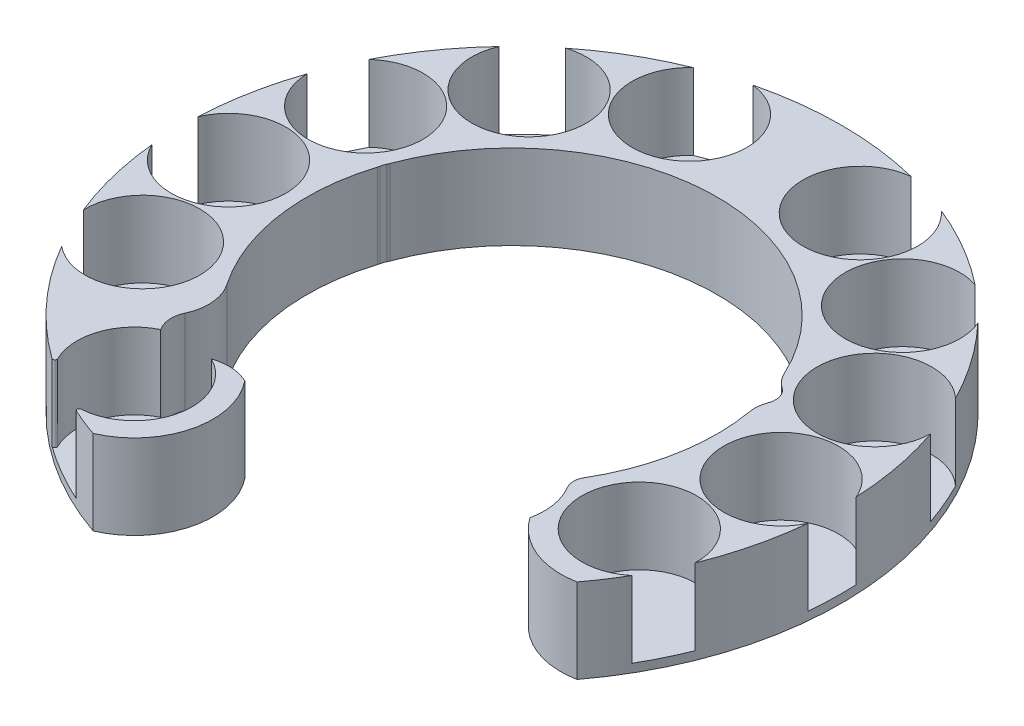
ISO-10303-21;
HEADER;
FILE_DESCRIPTION(('STEP AP214'),'2;1');
FILE_NAME('part.step','',(''),(''),'','','');
FILE_SCHEMA(('AUTOMOTIVE_DESIGN { 1 0 10303 214 1 1 1 1 }'));
ENDSEC;
DATA;
#1=APPLICATION_CONTEXT('core data for automotive mechanical design processes');
#2=APPLICATION_PROTOCOL_DEFINITION('international standard','automotive_design',2000,#1);
#3=PRODUCT_CONTEXT('',#1,'mechanical');
#4=PRODUCT('Part','Part','',(#3));
#5=PRODUCT_RELATED_PRODUCT_CATEGORY('part','',(#4));
#6=PRODUCT_DEFINITION_FORMATION('','',#4);
#7=PRODUCT_DEFINITION_CONTEXT('part definition',#1,'design');
#8=PRODUCT_DEFINITION('design','',#6,#7);
#9=PRODUCT_DEFINITION_SHAPE('','',#8);
#10=(LENGTH_UNIT() NAMED_UNIT(*) SI_UNIT(.MILLI.,.METRE.));
#11=(NAMED_UNIT(*) PLANE_ANGLE_UNIT() SI_UNIT($,.RADIAN.));
#12=(NAMED_UNIT(*) SI_UNIT($,.STERADIAN.) SOLID_ANGLE_UNIT());
#13=UNCERTAINTY_MEASURE_WITH_UNIT(LENGTH_MEASURE(1.E-05),#10,'distance_accuracy_value','');
#14=(GEOMETRIC_REPRESENTATION_CONTEXT(3) GLOBAL_UNCERTAINTY_ASSIGNED_CONTEXT((#13)) GLOBAL_UNIT_ASSIGNED_CONTEXT((#10,
#11,#12)) REPRESENTATION_CONTEXT('',''));
#15=CARTESIAN_POINT('',(0.,0.,0.));
#16=DIRECTION('',(0.,0.,1.));
#17=DIRECTION('',(1.,0.,0.));
#18=AXIS2_PLACEMENT_3D('',#15,#16,#17);
#19=CARTESIAN_POINT('',(0.,25.4,0.));
#20=DIRECTION('',(0.,1.,0.));
#21=DIRECTION('',(0.,0.,1.));
#22=AXIS2_PLACEMENT_3D('',#19,#20,#21);
#23=PLANE('',#22);
#24=CARTESIAN_POINT('',(-41.5400000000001,25.4,71.9493905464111));
#25=DIRECTION('',(0.,-1.,0.));
#26=DIRECTION('',(0.,0.,1.));
#27=AXIS2_PLACEMENT_3D('',#24,#25,#26);
#28=CIRCLE('',#27,23.6);
#29=CARTESIAN_POINT('',(-23.146761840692,25.4,57.1626130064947));
#30=VERTEX_POINT('',#29);
#31=CARTESIAN_POINT('',(-32.2750559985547,25.4,93.6547081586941));
#32=VERTEX_POINT('',#31);
#33=EDGE_CURVE('E321',#30,#32,#28,.T.);
#34=ORIENTED_EDGE('',*,*,#33,.F.);
#35=CARTESIAN_POINT('',(0.,25.4,0.));
#36=DIRECTION('',(0.,1.,0.));
#37=DIRECTION('',(0.,0.,1.));
#38=AXIS2_PLACEMENT_3D('',#35,#36,#37);
#39=CIRCLE('',#38,61.6712);
#40=CARTESIAN_POINT('',(-23.923346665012,25.4,56.8419773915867));
#41=VERTEX_POINT('',#40);
#42=EDGE_CURVE('E345',#41,#30,#39,.T.);
#43=ORIENTED_EDGE('',*,*,#42,.F.);
#44=CARTESIAN_POINT('',(-29.3425561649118,25.4,69.7180431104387));
#45=DIRECTION('',(0.,1.,0.));
#46=DIRECTION('',(0.,0.,-1.));
#47=AXIS2_PLACEMENT_3D('',#44,#45,#46);
#48=CIRCLE('',#47,13.97);
#49=CARTESIAN_POINT('',(-33.8656610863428,25.4,56.5005387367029));
#50=VERTEX_POINT('',#49);
#51=EDGE_CURVE('E663',#41,#50,#48,.T.);
#52=ORIENTED_EDGE('',*,*,#51,.T.);
#53=CARTESIAN_POINT('',(-41.5400000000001,25.4,71.9493905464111));
#54=DIRECTION('',(0.,1.,0.));
#55=DIRECTION('',(0.,0.,1.));
#56=AXIS2_PLACEMENT_3D('',#53,#54,#55);
#57=CIRCLE('',#56,17.25);
#58=CARTESIAN_POINT('',(-40.3533921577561,25.4,89.1585294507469));
#59=VERTEX_POINT('',#58);
#60=EDGE_CURVE('E469',#59,#50,#57,.T.);
#61=ORIENTED_EDGE('',*,*,#60,.F.);
#62=CARTESIAN_POINT('',(-40.3097112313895,25.4,89.7920252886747));
#63=DIRECTION('',(0.,1.,0.));
#64=DIRECTION('',(0.,0.,1.));
#65=AXIS2_PLACEMENT_3D('',#62,#63,#64);
#66=CIRCLE('',#65,0.635);
#67=CARTESIAN_POINT('',(-40.5697738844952,25.4,90.3713286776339));
#68=VERTEX_POINT('',#67);
#69=EDGE_CURVE('E443',#59,#68,#66,.T.);
#70=ORIENTED_EDGE('',*,*,#69,.T.);
#71=CARTESIAN_POINT('',(0.,25.4,0.));
#72=DIRECTION('',(0.,1.,0.));
#73=DIRECTION('',(0.,0.,1.));
#74=AXIS2_PLACEMENT_3D('',#71,#72,#73);
#75=CIRCLE('',#74,99.06);
#76=EDGE_CURVE('E341',#68,#32,#75,.T.);
#77=ORIENTED_EDGE('',*,*,#76,.T.);
#78=EDGE_LOOP('',(#34,#43,#52,#61,#70,#77));
#79=FACE_BOUND('',#78,.T.);
#80=ADVANCED_FACE('F35',(#79),#23,.T.);
#81=CARTESIAN_POINT('',(0.,25.4,0.));
#82=DIRECTION('',(0.,-1.,0.));
#83=DIRECTION('',(0.,0.,-1.));
#84=AXIS2_PLACEMENT_3D('',#81,#82,#83);
#85=CYLINDRICAL_SURFACE('',#84,61.6712);
#86=CARTESIAN_POINT('',(-58.8589391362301,25.4,-18.4109259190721));
#87=VERTEX_POINT('',#86);
#88=CARTESIAN_POINT('',(-50.9142683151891,25.4,34.8004912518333));
#89=VERTEX_POINT('',#88);
#90=EDGE_CURVE('E346',#87,#89,#39,.T.);
#91=ORIENTED_EDGE('',*,*,#90,.T.);
#92=DIRECTION('',(0.,-1.,0.));
#93=VECTOR('',#92,1.);
#94=CARTESIAN_POINT('',(-50.9142683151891,25.4,34.8004912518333));
#95=LINE('',#94,#93);
#96=CARTESIAN_POINT('',(-50.9142683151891,0.,34.8004912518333));
#97=VERTEX_POINT('',#96);
#98=EDGE_CURVE('E507',#89,#97,#95,.T.);
#99=ORIENTED_EDGE('',*,*,#98,.T.);
#100=CARTESIAN_POINT('',(0.,0.,0.));
#101=DIRECTION('',(0.,1.,0.));
#102=DIRECTION('',(0.,0.,1.));
#103=AXIS2_PLACEMENT_3D('',#100,#101,#102);
#104=CIRCLE('',#103,61.6712);
#105=CARTESIAN_POINT('',(-58.8589391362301,0.,-18.4109259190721));
#106=VERTEX_POINT('',#105);
#107=EDGE_CURVE('E486',#106,#97,#104,.T.);
#108=ORIENTED_EDGE('',*,*,#107,.F.);
#109=DIRECTION('',(0.,-1.,0.));
#110=VECTOR('',#109,1.);
#111=CARTESIAN_POINT('',(-58.8589391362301,25.4,-18.4109259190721));
#112=LINE('',#111,#110);
#113=EDGE_CURVE('E505',#87,#106,#112,.T.);
#114=ORIENTED_EDGE('',*,*,#113,.F.);
#115=EDGE_LOOP('',(#91,#99,#108,#114));
#116=FACE_BOUND('',#115,.T.);
#117=ADVANCED_FACE('F504',(#116),#85,.F.);
#118=CARTESIAN_POINT('',(-41.5400000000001,-48.7903679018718,71.9493905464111));
#119=DIRECTION('',(0.,1.,0.));
#120=DIRECTION('',(0.,0.,1.));
#121=AXIS2_PLACEMENT_3D('',#118,#119,#120);
#122=CYLINDRICAL_SURFACE('',#121,17.25);
#123=ORIENTED_EDGE('',*,*,#60,.T.);
#124=DIRECTION('',(0.,-1.,0.));
#125=VECTOR('',#124,1.);
#126=CARTESIAN_POINT('',(-33.8656610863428,12.7,56.5005387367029));
#127=LINE('',#126,#125);
#128=CARTESIAN_POINT('',(-33.8656610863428,2.54,56.5005387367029));
#129=VERTEX_POINT('',#128);
#130=EDGE_CURVE('E457',#50,#129,#127,.T.);
#131=ORIENTED_EDGE('',*,*,#130,.T.);
#132=CARTESIAN_POINT('',(-41.5400000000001,2.54,71.9493905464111));
#133=DIRECTION('',(0.,1.,0.));
#134=DIRECTION('',(0.,0.,1.));
#135=AXIS2_PLACEMENT_3D('',#132,#133,#134);
#136=CIRCLE('',#135,17.25);
#137=CARTESIAN_POINT('',(-40.3533921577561,2.54,89.1585294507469));
#138=VERTEX_POINT('',#137);
#139=EDGE_CURVE('E467',#129,#138,#136,.F.);
#140=ORIENTED_EDGE('',*,*,#139,.T.);
#141=DIRECTION('',(0.,1.,0.));
#142=VECTOR('',#141,1.);
#143=CARTESIAN_POINT('',(-40.3533921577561,-48.7903679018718,89.1585294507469));
#144=LINE('',#143,#142);
#145=EDGE_CURVE('E438',#138,#59,#144,.T.);
#146=ORIENTED_EDGE('',*,*,#145,.T.);
#147=EDGE_LOOP('',(#123,#131,#140,#146));
#148=FACE_BOUND('',#147,.T.);
#149=ADVANCED_FACE('F466',(#148),#122,.F.);
#150=CARTESIAN_POINT('',(53.1151758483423,25.4,31.3387141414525));
#151=VERTEX_POINT('',#150);
#152=CARTESIAN_POINT('',(60.7581620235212,25.4,-10.5727317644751));
#153=VERTEX_POINT('',#152);
#154=EDGE_CURVE('E336',#151,#153,#39,.T.);
#155=ORIENTED_EDGE('',*,*,#154,.T.);
#156=DIRECTION('',(0.,-1.,0.));
#157=VECTOR('',#156,1.);
#158=CARTESIAN_POINT('',(60.7581620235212,25.4,-10.5727317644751));
#159=LINE('',#158,#157);
#160=CARTESIAN_POINT('',(60.7581620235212,0.,-10.5727317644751));
#161=VERTEX_POINT('',#160);
#162=EDGE_CURVE('E532',#153,#161,#159,.T.);
#163=ORIENTED_EDGE('',*,*,#162,.T.);
#164=CARTESIAN_POINT('',(53.1151758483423,0.,31.3387141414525));
#165=VERTEX_POINT('',#164);
#166=EDGE_CURVE('E483',#165,#161,#104,.T.);
#167=ORIENTED_EDGE('',*,*,#166,.F.);
#168=DIRECTION('',(0.,-1.,0.));
#169=VECTOR('',#168,1.);
#170=CARTESIAN_POINT('',(53.1151758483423,25.4,31.3387141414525));
#171=LINE('',#170,#169);
#172=EDGE_CURVE('E583',#151,#165,#171,.T.);
#173=ORIENTED_EDGE('',*,*,#172,.F.);
#174=EDGE_LOOP('',(#155,#163,#167,#173));
#175=FACE_BOUND('',#174,.T.);
#176=ADVANCED_FACE('F738',(#175),#85,.F.);
#177=DIRECTION('',(0.,-1.,0.));
#178=VECTOR('',#177,1.);
#179=CARTESIAN_POINT('',(55.9881167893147,25.4,-25.8586095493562));
#180=LINE('',#179,#178);
#181=CARTESIAN_POINT('',(55.9881167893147,25.4,-25.8586095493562));
#182=VERTEX_POINT('',#181);
#183=CARTESIAN_POINT('',(55.9881167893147,0.,-25.8586095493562));
#184=VERTEX_POINT('',#183);
#185=EDGE_CURVE('E543',#182,#184,#180,.T.);
#186=ORIENTED_EDGE('',*,*,#185,.F.);
#187=CARTESIAN_POINT('',(-57.8967501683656,25.4,-21.2438986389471));
#188=VERTEX_POINT('',#187);
#189=EDGE_CURVE('E343',#182,#188,#39,.T.);
#190=ORIENTED_EDGE('',*,*,#189,.T.);
#191=DIRECTION('',(0.,-1.,0.));
#192=VECTOR('',#191,1.);
#193=CARTESIAN_POINT('',(-57.8967501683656,25.4,-21.2438986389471));
#194=LINE('',#193,#192);
#195=CARTESIAN_POINT('',(-57.8967501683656,0.,-21.2438986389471));
#196=VERTEX_POINT('',#195);
#197=EDGE_CURVE('E566',#188,#196,#194,.T.);
#198=ORIENTED_EDGE('',*,*,#197,.T.);
#199=EDGE_CURVE('E485',#184,#196,#104,.T.);
#200=ORIENTED_EDGE('',*,*,#199,.F.);
#201=EDGE_LOOP('',(#186,#190,#198,#200));
#202=FACE_BOUND('',#201,.T.);
#203=ADVANCED_FACE('F741',(#202),#85,.F.);
#204=CARTESIAN_POINT('',(74.6718093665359,25.4,36.4198748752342));
#205=DIRECTION('',(0.,-1.,0.));
#206=DIRECTION('',(0.,0.,1.));
#207=AXIS2_PLACEMENT_3D('',#204,#205,#206);
#208=CIRCLE('',#207,23.6);
#209=CARTESIAN_POINT('',(79.1282822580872,25.4,59.5952896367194));
#210=VERTEX_POINT('',#209);
#211=CARTESIAN_POINT('',(55.3450275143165,25.4,49.963711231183));
#212=VERTEX_POINT('',#211);
#213=EDGE_CURVE('E58',#210,#212,#208,.T.);
#214=ORIENTED_EDGE('',*,*,#213,.F.);
#215=CARTESIAN_POINT('',(85.698613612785,25.4,49.6853220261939));
#216=VERTEX_POINT('',#215);
#217=EDGE_CURVE('E330',#210,#216,#75,.T.);
#218=ORIENTED_EDGE('',*,*,#217,.T.);
#219=CARTESIAN_POINT('',(74.6718093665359,25.4,36.4198748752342));
#220=DIRECTION('',(0.,1.,0.));
#221=DIRECTION('',(0.,0.,1.));
#222=AXIS2_PLACEMENT_3D('',#219,#220,#221);
#223=CIRCLE('',#222,17.25);
#224=CARTESIAN_POINT('',(91.9139029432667,25.4,36.9420904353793));
#225=VERTEX_POINT('',#224);
#226=EDGE_CURVE('E585',#225,#216,#223,.T.);
#227=ORIENTED_EDGE('',*,*,#226,.F.);
#228=CARTESIAN_POINT('',(98.5865866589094,25.4,9.67308280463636));
#229=VERTEX_POINT('',#228);
#230=EDGE_CURVE('E691',#225,#229,#75,.T.);
#231=ORIENTED_EDGE('',*,*,#230,.T.);
#232=CARTESIAN_POINT('',(83.0515305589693,25.4,2.17478086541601));
#233=DIRECTION('',(0.,1.,0.));
#234=DIRECTION('',(0.,0.,1.));
#235=AXIS2_PLACEMENT_3D('',#232,#233,#234);
#236=CIRCLE('',#235,17.25);
#237=CARTESIAN_POINT('',(98.9577272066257,25.4,-4.5002028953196));
#238=VERTEX_POINT('',#237);
#239=EDGE_CURVE('E592',#238,#229,#236,.T.);
#240=ORIENTED_EDGE('',*,*,#239,.F.);
#241=CARTESIAN_POINT('',(93.7213377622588,25.4,-32.0810605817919));
#242=VERTEX_POINT('',#241);
#243=EDGE_CURVE('E693',#238,#242,#75,.T.);
#244=ORIENTED_EDGE('',*,*,#243,.T.);
#245=CARTESIAN_POINT('',(76.4755432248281,25.4,-32.4619421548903));
#246=DIRECTION('',(0.,1.,0.));
#247=DIRECTION('',(0.,0.,1.));
#248=AXIS2_PLACEMENT_3D('',#245,#246,#247);
#249=CIRCLE('',#248,17.25);
#250=CARTESIAN_POINT('',(88.1814954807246,25.4,-45.1321111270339));
#251=VERTEX_POINT('',#250);
#252=EDGE_CURVE('E598',#251,#242,#249,.T.);
#253=ORIENTED_EDGE('',*,*,#252,.F.);
#254=CARTESIAN_POINT('',(71.9789885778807,25.4,-68.058128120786));
#255=VERTEX_POINT('',#254);
#256=EDGE_CURVE('E696',#251,#255,#75,.T.);
#257=ORIENTED_EDGE('',*,*,#256,.T.);
#258=CARTESIAN_POINT('',(56.1280344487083,25.4,-61.2530011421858));
#259=DIRECTION('',(0.,1.,0.));
#260=DIRECTION('',(0.,0.,1.));
#261=AXIS2_PLACEMENT_3D('',#258,#259,#260);
#262=CIRCLE('',#261,17.25);
#263=CARTESIAN_POINT('',(61.5257641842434,25.4,-77.636743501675));
#264=VERTEX_POINT('',#263);
#265=EDGE_CURVE('E604',#264,#255,#262,.T.);
#266=ORIENTED_EDGE('',*,*,#265,.F.);
#267=CARTESIAN_POINT('',(37.2748460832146,25.4,-91.7794609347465));
#268=VERTEX_POINT('',#267);
#269=EDGE_CURVE('E699',#264,#268,#75,.T.);
#270=ORIENTED_EDGE('',*,*,#269,.T.);
#271=CARTESIAN_POINT('',(25.6731318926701,25.4,-79.0137753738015));
#272=DIRECTION('',(0.,1.,0.));
#273=DIRECTION('',(0.,0.,1.));
#274=AXIS2_PLACEMENT_3D('',#271,#272,#273);
#275=CIRCLE('',#274,17.25);
#276=CARTESIAN_POINT('',(23.7906296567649,25.4,-96.1607484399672));
#277=VERTEX_POINT('',#276);
#278=EDGE_CURVE('E610',#277,#268,#275,.T.);
#279=ORIENTED_EDGE('',*,*,#278,.F.);
#280=CARTESIAN_POINT('',(-23.7906296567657,25.4,-96.160748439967));
#281=VERTEX_POINT('',#280);
#282=EDGE_CURVE('E702',#277,#281,#75,.T.);
#283=ORIENTED_EDGE('',*,*,#282,.T.);
#284=CARTESIAN_POINT('',(-25.6731318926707,25.4,-79.0137753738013));
#285=DIRECTION('',(0.,1.,0.));
#286=DIRECTION('',(0.,0.,1.));
#287=AXIS2_PLACEMENT_3D('',#284,#285,#286);
#288=CIRCLE('',#287,17.25);
#289=CARTESIAN_POINT('',(-37.2748460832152,25.4,-91.7794609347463));
#290=VERTEX_POINT('',#289);
#291=EDGE_CURVE('E616',#290,#281,#288,.T.);
#292=ORIENTED_EDGE('',*,*,#291,.F.);
#293=CARTESIAN_POINT('',(-61.525764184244,25.4,-77.6367435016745));
#294=VERTEX_POINT('',#293);
#295=EDGE_CURVE('E705',#290,#294,#75,.T.);
#296=ORIENTED_EDGE('',*,*,#295,.T.);
#297=CARTESIAN_POINT('',(-56.1280344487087,25.4,-61.2530011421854));
#298=DIRECTION('',(0.,1.,0.));
#299=DIRECTION('',(0.,0.,1.));
#300=AXIS2_PLACEMENT_3D('',#297,#298,#299);
#301=CIRCLE('',#300,17.25);
#302=CARTESIAN_POINT('',(-71.9789885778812,25.4,-68.0581281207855));
#303=VERTEX_POINT('',#302);
#304=EDGE_CURVE('E622',#303,#294,#301,.T.);
#305=ORIENTED_EDGE('',*,*,#304,.F.);
#306=CARTESIAN_POINT('',(-88.181495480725,25.4,-45.1321111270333));
#307=VERTEX_POINT('',#306);
#308=EDGE_CURVE('E708',#303,#307,#75,.T.);
#309=ORIENTED_EDGE('',*,*,#308,.T.);
#310=CARTESIAN_POINT('',(-76.4755432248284,25.4,-32.4619421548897));
#311=DIRECTION('',(0.,1.,0.));
#312=DIRECTION('',(0.,0.,1.));
#313=AXIS2_PLACEMENT_3D('',#310,#311,#312);
#314=CIRCLE('',#313,17.25);
#315=CARTESIAN_POINT('',(-93.7213377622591,25.4,-32.081060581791));
#316=VERTEX_POINT('',#315);
#317=EDGE_CURVE('E628',#316,#307,#314,.T.);
#318=ORIENTED_EDGE('',*,*,#317,.F.);
#319=CARTESIAN_POINT('',(-98.9577272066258,25.4,-4.50020289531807));
#320=VERTEX_POINT('',#319);
#321=EDGE_CURVE('E711',#316,#320,#75,.T.);
#322=ORIENTED_EDGE('',*,*,#321,.T.);
#323=CARTESIAN_POINT('',(-83.0515305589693,25.4,2.17478086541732));
#324=DIRECTION('',(0.,1.,0.));
#325=DIRECTION('',(0.,0.,1.));
#326=AXIS2_PLACEMENT_3D('',#323,#324,#325);
#327=CIRCLE('',#326,17.25);
#328=CARTESIAN_POINT('',(-98.5865866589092,25.4,9.67308280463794));
#329=VERTEX_POINT('',#328);
#330=EDGE_CURVE('E634',#329,#320,#327,.T.);
#331=ORIENTED_EDGE('',*,*,#330,.F.);
#332=CARTESIAN_POINT('',(-91.9139029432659,25.4,36.9420904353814));
#333=VERTEX_POINT('',#332);
#334=EDGE_CURVE('E339',#329,#333,#75,.T.);
#335=ORIENTED_EDGE('',*,*,#334,.T.);
#336=CARTESIAN_POINT('',(-74.6718093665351,25.4,36.4198748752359));
#337=DIRECTION('',(0.,1.,0.));
#338=DIRECTION('',(0.,0.,1.));
#339=AXIS2_PLACEMENT_3D('',#336,#337,#338);
#340=CIRCLE('',#339,17.25);
#341=CARTESIAN_POINT('',(-85.6986136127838,25.4,49.6853220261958));
#342=VERTEX_POINT('',#341);
#343=EDGE_CURVE('E640',#342,#333,#340,.T.);
#344=ORIENTED_EDGE('',*,*,#343,.F.);
#345=CARTESIAN_POINT('',(-57.9789794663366,25.4,80.3201191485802));
#346=VERTEX_POINT('',#345);
#347=EDGE_CURVE('E335',#342,#346,#75,.T.);
#348=ORIENTED_EDGE('',*,*,#347,.T.);
#349=CARTESIAN_POINT('',(-57.6073193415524,25.4,79.8052465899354));
#350=DIRECTION('',(0.,1.,0.));
#351=DIRECTION('',(0.,0.,1.));
#352=AXIS2_PLACEMENT_3D('',#349,#350,#351);
#353=CIRCLE('',#352,0.635);
#354=CARTESIAN_POINT('',(-57.036855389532,25.4,79.5263274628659));
#355=VERTEX_POINT('',#354);
#356=EDGE_CURVE('E440',#346,#355,#353,.T.);
#357=ORIENTED_EDGE('',*,*,#356,.T.);
#358=CARTESIAN_POINT('',(-49.1358629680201,25.4,56.461803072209));
#359=VERTEX_POINT('',#358);
#360=EDGE_CURVE('E480',#359,#355,#57,.T.);
#361=ORIENTED_EDGE('',*,*,#360,.F.);
#362=CARTESIAN_POINT('',(-42.418,25.4,51.9430000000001));
#363=DIRECTION('',(0.,-1.,0.));
#364=DIRECTION('',(0.,0.,-1.));
#365=AXIS2_PLACEMENT_3D('',#362,#363,#364);
#366=CIRCLE('',#365,8.09625000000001);
#367=CARTESIAN_POINT('',(-49.7669775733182,25.4,48.5456786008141));
#368=VERTEX_POINT('',#367);
#369=EDGE_CURVE('E662',#359,#368,#366,.T.);
#370=ORIENTED_EDGE('',*,*,#369,.T.);
#371=CARTESIAN_POINT('',(-62.4475663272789,25.4,42.6836338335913));
#372=DIRECTION('',(0.,1.,0.));
#373=DIRECTION('',(0.,0.,1.));
#374=AXIS2_PLACEMENT_3D('',#371,#372,#373);
#375=CIRCLE('',#374,13.97);
#376=EDGE_CURVE('E519',#368,#89,#375,.T.);
#377=ORIENTED_EDGE('',*,*,#376,.T.);
#378=ORIENTED_EDGE('',*,*,#90,.F.);
#379=CARTESIAN_POINT('',(-63.707286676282,25.4,-19.9274766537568));
#380=DIRECTION('',(0.,1.,0.));
#381=DIRECTION('',(0.,0.,-1.));
#382=AXIS2_PLACEMENT_3D('',#379,#380,#381);
#383=CIRCLE('',#382,5.08);
#384=CARTESIAN_POINT('',(-58.698268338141,25.4,-19.0812288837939));
#385=VERTEX_POINT('',#384);
#386=EDGE_CURVE('E547',#87,#385,#383,.T.);
#387=ORIENTED_EDGE('',*,*,#386,.T.);
#388=CARTESIAN_POINT('',(-53.68925,25.4,-18.2349811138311));
#389=DIRECTION('',(0.,-1.,0.));
#390=DIRECTION('',(0.,0.,-1.));
#391=AXIS2_PLACEMENT_3D('',#388,#389,#390);
#392=CIRCLE('',#391,5.08);
#393=CARTESIAN_POINT('',(-58.1775449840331,25.4,-20.614394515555));
#394=VERTEX_POINT('',#393);
#395=EDGE_CURVE('E550',#385,#394,#392,.T.);
#396=ORIENTED_EDGE('',*,*,#395,.T.);
#397=CARTESIAN_POINT('',(-62.6658399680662,25.4,-22.9938079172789));
#398=DIRECTION('',(0.,1.,0.));
#399=DIRECTION('',(0.,0.,1.));
#400=AXIS2_PLACEMENT_3D('',#397,#398,#399);
#401=CIRCLE('',#400,5.08);
#402=EDGE_CURVE('E554',#394,#188,#401,.T.);
#403=ORIENTED_EDGE('',*,*,#402,.T.);
#404=ORIENTED_EDGE('',*,*,#189,.F.);
#405=CARTESIAN_POINT('',(65.2118592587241,25.4,-30.1186770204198));
#406=DIRECTION('',(0.,1.,0.));
#407=DIRECTION('',(0.,0.,-1.));
#408=AXIS2_PLACEMENT_3D('',#405,#406,#407);
#409=CIRCLE('',#408,10.16);
#410=CARTESIAN_POINT('',(59.3927864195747,25.4,-21.7901722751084));
#411=VERTEX_POINT('',#410);
#412=EDGE_CURVE('E525',#182,#411,#409,.T.);
#413=ORIENTED_EDGE('',*,*,#412,.T.);
#414=CARTESIAN_POINT('',(56.48325,25.4,-17.6259199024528));
#415=DIRECTION('',(0.,-1.,0.));
#416=DIRECTION('',(0.,0.,1.));
#417=AXIS2_PLACEMENT_3D('',#414,#415,#416);
#418=CIRCLE('',#417,5.08);
#419=CARTESIAN_POINT('',(61.2447479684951,25.4,-15.855457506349));
#420=VERTEX_POINT('',#419);
#421=EDGE_CURVE('E529',#411,#420,#418,.T.);
#422=ORIENTED_EDGE('',*,*,#421,.T.);
#423=CARTESIAN_POINT('',(70.7677439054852,25.4,-12.3145327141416));
#424=DIRECTION('',(0.,1.,0.));
#425=DIRECTION('',(0.,0.,1.));
#426=AXIS2_PLACEMENT_3D('',#423,#424,#425);
#427=CIRCLE('',#426,10.16);
#428=EDGE_CURVE('E522',#420,#153,#427,.T.);
#429=ORIENTED_EDGE('',*,*,#428,.T.);
#430=ORIENTED_EDGE('',*,*,#154,.F.);
#431=CARTESIAN_POINT('',(57.490396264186,25.4,33.9201568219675));
#432=DIRECTION('',(0.,1.,0.));
#433=DIRECTION('',(0.,0.,-1.));
#434=AXIS2_PLACEMENT_3D('',#431,#432,#433);
#435=CIRCLE('',#434,5.08);
#436=CARTESIAN_POINT('',(53.1247714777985,25.4,36.5177942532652));
#437=VERTEX_POINT('',#436);
#438=EDGE_CURVE('E572',#151,#437,#435,.T.);
#439=ORIENTED_EDGE('',*,*,#438,.T.);
#440=CARTESIAN_POINT('',(37.0597912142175,25.4,46.0767912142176));
#441=DIRECTION('',(0.,-1.,0.));
#442=DIRECTION('',(0.,0.,1.));
#443=AXIS2_PLACEMENT_3D('',#440,#441,#442);
#444=CIRCLE('',#443,18.6937961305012);
#445=EDGE_CURVE('E575',#437,#212,#444,.T.);
#446=ORIENTED_EDGE('',*,*,#445,.T.);
#447=EDGE_LOOP('',(#214,#218,#227,#231,#240,#244,#253,#257,#266,#270,#279,#283,#292,#296,#305,
#309,#318,#322,#331,#335,#344,#348,#357,#361,#370,#377,#378,#387,#396,#403,#404,#413,#422,#429,
#430,#439,#446));
#448=FACE_BOUND('',#447,.T.);
#449=ADVANCED_FACE('F653',(#448),#23,.T.);
#450=CARTESIAN_POINT('',(0.,0.,0.));
#451=DIRECTION('',(0.,1.,0.));
#452=DIRECTION('',(0.,0.,1.));
#453=AXIS2_PLACEMENT_3D('',#450,#451,#452);
#454=PLANE('',#453);
#455=CARTESIAN_POINT('',(-23.923346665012,0.,56.8419773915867));
#456=VERTEX_POINT('',#455);
#457=CARTESIAN_POINT('',(-23.146761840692,0.,57.1626130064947));
#458=VERTEX_POINT('',#457);
#459=EDGE_CURVE('E479',#456,#458,#104,.T.);
#460=ORIENTED_EDGE('',*,*,#459,.T.);
#461=CARTESIAN_POINT('',(-41.5400000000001,0.,71.9493905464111));
#462=DIRECTION('',(0.,-1.,0.));
#463=DIRECTION('',(0.,0.,1.));
#464=AXIS2_PLACEMENT_3D('',#461,#462,#463);
#465=CIRCLE('',#464,23.6);
#466=CARTESIAN_POINT('',(-32.2750559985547,0.,93.6547081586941));
#467=VERTEX_POINT('',#466);
#468=EDGE_CURVE('E50',#458,#467,#465,.T.);
#469=ORIENTED_EDGE('',*,*,#468,.T.);
#470=CARTESIAN_POINT('',(0.,0.,0.));
#471=DIRECTION('',(0.,1.,0.));
#472=DIRECTION('',(0.,0.,1.));
#473=AXIS2_PLACEMENT_3D('',#470,#471,#472);
#474=CIRCLE('',#473,99.06);
#475=CARTESIAN_POINT('',(79.1282822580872,0.,59.5952896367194));
#476=VERTEX_POINT('',#475);
#477=EDGE_CURVE('E328',#476,#467,#474,.T.);
#478=ORIENTED_EDGE('',*,*,#477,.F.);
#479=CARTESIAN_POINT('',(74.6718093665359,0.,36.4198748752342));
#480=DIRECTION('',(0.,-1.,0.));
#481=DIRECTION('',(0.,0.,1.));
#482=AXIS2_PLACEMENT_3D('',#479,#480,#481);
#483=CIRCLE('',#482,23.6);
#484=CARTESIAN_POINT('',(55.3450275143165,0.,49.963711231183));
#485=VERTEX_POINT('',#484);
#486=EDGE_CURVE('E313',#476,#485,#483,.T.);
#487=ORIENTED_EDGE('',*,*,#486,.T.);
#488=CARTESIAN_POINT('',(37.0597912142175,0.,46.0767912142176));
#489=DIRECTION('',(0.,-1.,0.));
#490=DIRECTION('',(0.,0.,1.));
#491=AXIS2_PLACEMENT_3D('',#488,#489,#490);
#492=CIRCLE('',#491,18.6937961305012);
#493=CARTESIAN_POINT('',(53.1247714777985,0.,36.5177942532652));
#494=VERTEX_POINT('',#493);
#495=EDGE_CURVE('E576',#494,#485,#492,.T.);
#496=ORIENTED_EDGE('',*,*,#495,.F.);
#497=CARTESIAN_POINT('',(57.490396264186,0.,33.9201568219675));
#498=DIRECTION('',(0.,1.,0.));
#499=DIRECTION('',(0.,0.,-1.));
#500=AXIS2_PLACEMENT_3D('',#497,#498,#499);
#501=CIRCLE('',#500,5.08);
#502=EDGE_CURVE('E565',#165,#494,#501,.T.);
#503=ORIENTED_EDGE('',*,*,#502,.F.);
#504=ORIENTED_EDGE('',*,*,#166,.T.);
#505=CARTESIAN_POINT('',(70.7677439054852,0.,-12.3145327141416));
#506=DIRECTION('',(0.,1.,0.));
#507=DIRECTION('',(0.,0.,1.));
#508=AXIS2_PLACEMENT_3D('',#505,#506,#507);
#509=CIRCLE('',#508,10.16);
#510=CARTESIAN_POINT('',(61.2447479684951,0.,-15.855457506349));
#511=VERTEX_POINT('',#510);
#512=EDGE_CURVE('E470',#511,#161,#509,.T.);
#513=ORIENTED_EDGE('',*,*,#512,.F.);
#514=CARTESIAN_POINT('',(56.48325,0.,-17.6259199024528));
#515=DIRECTION('',(0.,-1.,0.));
#516=DIRECTION('',(0.,0.,1.));
#517=AXIS2_PLACEMENT_3D('',#514,#515,#516);
#518=CIRCLE('',#517,5.08);
#519=CARTESIAN_POINT('',(59.3927864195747,0.,-21.7901722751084));
#520=VERTEX_POINT('',#519);
#521=EDGE_CURVE('E526',#520,#511,#518,.T.);
#522=ORIENTED_EDGE('',*,*,#521,.F.);
#523=CARTESIAN_POINT('',(65.2118592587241,0.,-30.1186770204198));
#524=DIRECTION('',(0.,1.,0.));
#525=DIRECTION('',(0.,0.,-1.));
#526=AXIS2_PLACEMENT_3D('',#523,#524,#525);
#527=CIRCLE('',#526,10.16);
#528=EDGE_CURVE('E534',#184,#520,#527,.T.);
#529=ORIENTED_EDGE('',*,*,#528,.F.);
#530=ORIENTED_EDGE('',*,*,#199,.T.);
#531=CARTESIAN_POINT('',(-62.6658399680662,0.,-22.9938079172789));
#532=DIRECTION('',(0.,1.,0.));
#533=DIRECTION('',(0.,0.,1.));
#534=AXIS2_PLACEMENT_3D('',#531,#532,#533);
#535=CIRCLE('',#534,5.08);
#536=CARTESIAN_POINT('',(-58.1775449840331,0.,-20.614394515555));
#537=VERTEX_POINT('',#536);
#538=EDGE_CURVE('E551',#537,#196,#535,.T.);
#539=ORIENTED_EDGE('',*,*,#538,.F.);
#540=CARTESIAN_POINT('',(-53.68925,0.,-18.2349811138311));
#541=DIRECTION('',(0.,-1.,0.));
#542=DIRECTION('',(0.,0.,-1.));
#543=AXIS2_PLACEMENT_3D('',#540,#541,#542);
#544=CIRCLE('',#543,5.08);
#545=CARTESIAN_POINT('',(-58.698268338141,0.,-19.0812288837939));
#546=VERTEX_POINT('',#545);
#547=EDGE_CURVE('E559',#546,#537,#544,.T.);
#548=ORIENTED_EDGE('',*,*,#547,.F.);
#549=CARTESIAN_POINT('',(-63.707286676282,0.,-19.9274766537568));
#550=DIRECTION('',(0.,1.,0.));
#551=DIRECTION('',(0.,0.,-1.));
#552=AXIS2_PLACEMENT_3D('',#549,#550,#551);
#553=CIRCLE('',#552,5.08);
#554=EDGE_CURVE('E499',#106,#546,#553,.T.);
#555=ORIENTED_EDGE('',*,*,#554,.F.);
#556=ORIENTED_EDGE('',*,*,#107,.T.);
#557=CARTESIAN_POINT('',(-62.4475663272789,0.,42.6836338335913));
#558=DIRECTION('',(0.,1.,0.));
#559=DIRECTION('',(0.,0.,1.));
#560=AXIS2_PLACEMENT_3D('',#557,#558,#559);
#561=CIRCLE('',#560,13.97);
#562=CARTESIAN_POINT('',(-49.7669775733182,0.,48.5456786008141));
#563=VERTEX_POINT('',#562);
#564=EDGE_CURVE('E496',#563,#97,#561,.T.);
#565=ORIENTED_EDGE('',*,*,#564,.F.);
#566=CARTESIAN_POINT('',(-42.418,0.,51.9430000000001));
#567=DIRECTION('',(0.,-1.,0.));
#568=DIRECTION('',(0.,0.,-1.));
#569=AXIS2_PLACEMENT_3D('',#566,#567,#568);
#570=CIRCLE('',#569,8.09625000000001);
#571=CARTESIAN_POINT('',(-37.620534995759,0.,58.4647784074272));
#572=VERTEX_POINT('',#571);
#573=EDGE_CURVE('E670',#572,#563,#570,.T.);
#574=ORIENTED_EDGE('',*,*,#573,.F.);
#575=CARTESIAN_POINT('',(-29.3425561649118,0.,69.7180431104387));
#576=DIRECTION('',(0.,1.,0.));
#577=DIRECTION('',(0.,0.,-1.));
#578=AXIS2_PLACEMENT_3D('',#575,#576,#577);
#579=CIRCLE('',#578,13.97);
#580=EDGE_CURVE('E668',#456,#572,#579,.T.);
#581=ORIENTED_EDGE('',*,*,#580,.F.);
#582=EDGE_LOOP('',(#460,#469,#478,#487,#496,#503,#504,#513,#522,#529,#530,#539,#548,#555,#556,
#565,#574,#581));
#583=FACE_BOUND('',#582,.T.);
#584=ADVANCED_FACE('F334',(#583),#454,.F.);
#585=CARTESIAN_POINT('',(0.,25.4,0.));
#586=DIRECTION('',(0.,-1.,0.));
#587=DIRECTION('',(0.,0.,-1.));
#588=AXIS2_PLACEMENT_3D('',#585,#586,#587);
#589=CYLINDRICAL_SURFACE('',#588,99.06);
#590=ORIENTED_EDGE('',*,*,#477,.T.);
#591=DIRECTION('',(0.,1.,0.));
#592=VECTOR('',#591,1.);
#593=CARTESIAN_POINT('',(-32.2750559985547,0.,93.6547081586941));
#594=LINE('',#593,#592);
#595=EDGE_CURVE('E671',#467,#32,#594,.T.);
#596=ORIENTED_EDGE('',*,*,#595,.T.);
#597=ORIENTED_EDGE('',*,*,#76,.F.);
#598=DIRECTION('',(0.,-1.,0.));
#599=VECTOR('',#598,1.);
#600=CARTESIAN_POINT('',(-40.5697738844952,25.4,90.3713286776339));
#601=LINE('',#600,#599);
#602=CARTESIAN_POINT('',(-40.5697738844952,2.54,90.3713286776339));
#603=VERTEX_POINT('',#602);
#604=EDGE_CURVE('E433',#68,#603,#601,.T.);
#605=ORIENTED_EDGE('',*,*,#604,.T.);
#606=CARTESIAN_POINT('',(0.,2.54,0.));
#607=DIRECTION('',(0.,1.,0.));
#608=DIRECTION('',(0.,0.,1.));
#609=AXIS2_PLACEMENT_3D('',#606,#607,#608);
#610=CIRCLE('',#609,99.06);
#611=CARTESIAN_POINT('',(-57.9789794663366,2.54,80.3201191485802));
#612=VERTEX_POINT('',#611);
#613=EDGE_CURVE('E349',#612,#603,#610,.T.);
#614=ORIENTED_EDGE('',*,*,#613,.F.);
#615=DIRECTION('',(0.,-1.,0.));
#616=VECTOR('',#615,1.);
#617=CARTESIAN_POINT('',(-57.9789794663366,25.4,80.3201191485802));
#618=LINE('',#617,#616);
#619=EDGE_CURVE('E430',#612,#346,#618,.F.);
#620=ORIENTED_EDGE('',*,*,#619,.T.);
#621=ORIENTED_EDGE('',*,*,#347,.F.);
#622=DIRECTION('',(0.,1.,0.));
#623=VECTOR('',#622,1.);
#624=CARTESIAN_POINT('',(-85.6986136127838,13.97,49.6853220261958));
#625=LINE('',#624,#623);
#626=CARTESIAN_POINT('',(-85.6986136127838,2.54,49.6853220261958));
#627=VERTEX_POINT('',#626);
#628=EDGE_CURVE('E353',#342,#627,#625,.F.);
#629=ORIENTED_EDGE('',*,*,#628,.T.);
#630=CARTESIAN_POINT('',(0.,2.54,0.));
#631=DIRECTION('',(0.,1.,0.));
#632=DIRECTION('',(0.,0.,1.));
#633=AXIS2_PLACEMENT_3D('',#630,#631,#632);
#634=CIRCLE('',#633,99.06);
#635=CARTESIAN_POINT('',(-91.9139029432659,2.54,36.9420904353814));
#636=VERTEX_POINT('',#635);
#637=EDGE_CURVE('E351',#636,#627,#634,.T.);
#638=ORIENTED_EDGE('',*,*,#637,.F.);
#639=DIRECTION('',(0.,1.,0.));
#640=VECTOR('',#639,1.);
#641=CARTESIAN_POINT('',(-91.9139029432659,13.97,36.9420904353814));
#642=LINE('',#641,#640);
#643=EDGE_CURVE('E356',#636,#333,#642,.T.);
#644=ORIENTED_EDGE('',*,*,#643,.T.);
#645=ORIENTED_EDGE('',*,*,#334,.F.);
#646=DIRECTION('',(0.,1.,0.));
#647=VECTOR('',#646,1.);
#648=CARTESIAN_POINT('',(-98.5865866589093,13.97,9.67308280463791));
#649=LINE('',#648,#647);
#650=CARTESIAN_POINT('',(-98.5865866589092,2.54,9.67308280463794));
#651=VERTEX_POINT('',#650);
#652=EDGE_CURVE('E361',#329,#651,#649,.F.);
#653=ORIENTED_EDGE('',*,*,#652,.T.);
#654=CARTESIAN_POINT('',(0.,2.54,0.));
#655=DIRECTION('',(0.,1.,0.));
#656=DIRECTION('',(0.,0.,1.));
#657=AXIS2_PLACEMENT_3D('',#654,#655,#656);
#658=CIRCLE('',#657,99.06);
#659=CARTESIAN_POINT('',(-98.9577272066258,2.54,-4.50020289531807));
#660=VERTEX_POINT('',#659);
#661=EDGE_CURVE('E359',#660,#651,#658,.T.);
#662=ORIENTED_EDGE('',*,*,#661,.F.);
#663=DIRECTION('',(0.,1.,0.));
#664=VECTOR('',#663,1.);
#665=CARTESIAN_POINT('',(-98.9577272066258,13.97,-4.50020289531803));
#666=LINE('',#665,#664);
#667=EDGE_CURVE('E364',#660,#320,#666,.T.);
#668=ORIENTED_EDGE('',*,*,#667,.T.);
#669=ORIENTED_EDGE('',*,*,#321,.F.);
#670=DIRECTION('',(0.,1.,0.));
#671=VECTOR('',#670,1.);
#672=CARTESIAN_POINT('',(-93.7213377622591,13.97,-32.0810605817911));
#673=LINE('',#672,#671);
#674=CARTESIAN_POINT('',(-93.7213377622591,2.54,-32.081060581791));
#675=VERTEX_POINT('',#674);
#676=EDGE_CURVE('E369',#316,#675,#673,.F.);
#677=ORIENTED_EDGE('',*,*,#676,.T.);
#678=CARTESIAN_POINT('',(0.,2.54,0.));
#679=DIRECTION('',(0.,1.,0.));
#680=DIRECTION('',(0.,0.,1.));
#681=AXIS2_PLACEMENT_3D('',#678,#679,#680);
#682=CIRCLE('',#681,99.06);
#683=CARTESIAN_POINT('',(-88.181495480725,2.54,-45.1321111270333));
#684=VERTEX_POINT('',#683);
#685=EDGE_CURVE('E367',#684,#675,#682,.T.);
#686=ORIENTED_EDGE('',*,*,#685,.F.);
#687=DIRECTION('',(0.,1.,0.));
#688=VECTOR('',#687,1.);
#689=CARTESIAN_POINT('',(-88.1814954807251,13.97,-45.1321111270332));
#690=LINE('',#689,#688);
#691=EDGE_CURVE('E372',#684,#307,#690,.T.);
#692=ORIENTED_EDGE('',*,*,#691,.T.);
#693=ORIENTED_EDGE('',*,*,#308,.F.);
#694=DIRECTION('',(0.,1.,0.));
#695=VECTOR('',#694,1.);
#696=CARTESIAN_POINT('',(-71.9789885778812,13.97,-68.0581281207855));
#697=LINE('',#696,#695);
#698=CARTESIAN_POINT('',(-71.9789885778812,2.54,-68.0581281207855));
#699=VERTEX_POINT('',#698);
#700=EDGE_CURVE('E377',#303,#699,#697,.F.);
#701=ORIENTED_EDGE('',*,*,#700,.T.);
#702=CARTESIAN_POINT('',(0.,2.54,0.));
#703=DIRECTION('',(0.,1.,0.));
#704=DIRECTION('',(0.,0.,1.));
#705=AXIS2_PLACEMENT_3D('',#702,#703,#704);
#706=CIRCLE('',#705,99.06);
#707=CARTESIAN_POINT('',(-61.525764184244,2.54,-77.6367435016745));
#708=VERTEX_POINT('',#707);
#709=EDGE_CURVE('E375',#708,#699,#706,.T.);
#710=ORIENTED_EDGE('',*,*,#709,.F.);
#711=DIRECTION('',(0.,1.,0.));
#712=VECTOR('',#711,1.);
#713=CARTESIAN_POINT('',(-61.525764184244,13.97,-77.6367435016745));
#714=LINE('',#713,#712);
#715=EDGE_CURVE('E380',#708,#294,#714,.T.);
#716=ORIENTED_EDGE('',*,*,#715,.T.);
#717=ORIENTED_EDGE('',*,*,#295,.F.);
#718=DIRECTION('',(0.,1.,0.));
#719=VECTOR('',#718,1.);
#720=CARTESIAN_POINT('',(-37.2748460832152,13.97,-91.7794609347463));
#721=LINE('',#720,#719);
#722=CARTESIAN_POINT('',(-37.2748460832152,2.54,-91.7794609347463));
#723=VERTEX_POINT('',#722);
#724=EDGE_CURVE('E385',#290,#723,#721,.F.);
#725=ORIENTED_EDGE('',*,*,#724,.T.);
#726=CARTESIAN_POINT('',(0.,2.54,0.));
#727=DIRECTION('',(0.,1.,0.));
#728=DIRECTION('',(0.,0.,1.));
#729=AXIS2_PLACEMENT_3D('',#726,#727,#728);
#730=CIRCLE('',#729,99.06);
#731=CARTESIAN_POINT('',(-23.7906296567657,2.54,-96.160748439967));
#732=VERTEX_POINT('',#731);
#733=EDGE_CURVE('E383',#732,#723,#730,.T.);
#734=ORIENTED_EDGE('',*,*,#733,.F.);
#735=DIRECTION('',(0.,1.,0.));
#736=VECTOR('',#735,1.);
#737=CARTESIAN_POINT('',(-23.7906296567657,13.97,-96.160748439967));
#738=LINE('',#737,#736);
#739=EDGE_CURVE('E388',#732,#281,#738,.T.);
#740=ORIENTED_EDGE('',*,*,#739,.T.);
#741=ORIENTED_EDGE('',*,*,#282,.F.);
#742=DIRECTION('',(0.,1.,0.));
#743=VECTOR('',#742,1.);
#744=CARTESIAN_POINT('',(23.790629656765,13.97,-96.1607484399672));
#745=LINE('',#744,#743);
#746=CARTESIAN_POINT('',(23.7906296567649,2.54,-96.1607484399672));
#747=VERTEX_POINT('',#746);
#748=EDGE_CURVE('E393',#277,#747,#745,.F.);
#749=ORIENTED_EDGE('',*,*,#748,.T.);
#750=CARTESIAN_POINT('',(0.,2.54,0.));
#751=DIRECTION('',(0.,1.,0.));
#752=DIRECTION('',(0.,0.,1.));
#753=AXIS2_PLACEMENT_3D('',#750,#751,#752);
#754=CIRCLE('',#753,99.06);
#755=CARTESIAN_POINT('',(37.2748460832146,2.54,-91.7794609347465));
#756=VERTEX_POINT('',#755);
#757=EDGE_CURVE('E391',#756,#747,#754,.T.);
#758=ORIENTED_EDGE('',*,*,#757,.F.);
#759=DIRECTION('',(0.,1.,0.));
#760=VECTOR('',#759,1.);
#761=CARTESIAN_POINT('',(37.2748460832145,13.97,-91.7794609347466));
#762=LINE('',#761,#760);
#763=EDGE_CURVE('E396',#756,#268,#762,.T.);
#764=ORIENTED_EDGE('',*,*,#763,.T.);
#765=ORIENTED_EDGE('',*,*,#269,.F.);
#766=DIRECTION('',(0.,1.,0.));
#767=VECTOR('',#766,1.);
#768=CARTESIAN_POINT('',(61.5257641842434,13.97,-77.636743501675));
#769=LINE('',#768,#767);
#770=CARTESIAN_POINT('',(61.5257641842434,2.54,-77.636743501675));
#771=VERTEX_POINT('',#770);
#772=EDGE_CURVE('E401',#264,#771,#769,.F.);
#773=ORIENTED_EDGE('',*,*,#772,.T.);
#774=CARTESIAN_POINT('',(0.,2.54,0.));
#775=DIRECTION('',(0.,1.,0.));
#776=DIRECTION('',(0.,0.,1.));
#777=AXIS2_PLACEMENT_3D('',#774,#775,#776);
#778=CIRCLE('',#777,99.06);
#779=CARTESIAN_POINT('',(71.9789885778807,2.54,-68.058128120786));
#780=VERTEX_POINT('',#779);
#781=EDGE_CURVE('E399',#780,#771,#778,.T.);
#782=ORIENTED_EDGE('',*,*,#781,.F.);
#783=DIRECTION('',(0.,1.,0.));
#784=VECTOR('',#783,1.);
#785=CARTESIAN_POINT('',(71.9789885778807,13.97,-68.058128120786));
#786=LINE('',#785,#784);
#787=EDGE_CURVE('E404',#780,#255,#786,.T.);
#788=ORIENTED_EDGE('',*,*,#787,.T.);
#789=ORIENTED_EDGE('',*,*,#256,.F.);
#790=DIRECTION('',(0.,1.,0.));
#791=VECTOR('',#790,1.);
#792=CARTESIAN_POINT('',(88.1814954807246,13.97,-45.1321111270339));
#793=LINE('',#792,#791);
#794=CARTESIAN_POINT('',(88.1814954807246,2.54,-45.1321111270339));
#795=VERTEX_POINT('',#794);
#796=EDGE_CURVE('E409',#251,#795,#793,.F.);
#797=ORIENTED_EDGE('',*,*,#796,.T.);
#798=CARTESIAN_POINT('',(0.,2.54,0.));
#799=DIRECTION('',(0.,1.,0.));
#800=DIRECTION('',(0.,0.,1.));
#801=AXIS2_PLACEMENT_3D('',#798,#799,#800);
#802=CIRCLE('',#801,99.06);
#803=CARTESIAN_POINT('',(93.7213377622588,2.54,-32.0810605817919));
#804=VERTEX_POINT('',#803);
#805=EDGE_CURVE('E407',#804,#795,#802,.T.);
#806=ORIENTED_EDGE('',*,*,#805,.F.);
#807=DIRECTION('',(0.,1.,0.));
#808=VECTOR('',#807,1.);
#809=CARTESIAN_POINT('',(93.7213377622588,13.97,-32.0810605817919));
#810=LINE('',#809,#808);
#811=EDGE_CURVE('E412',#804,#242,#810,.T.);
#812=ORIENTED_EDGE('',*,*,#811,.T.);
#813=ORIENTED_EDGE('',*,*,#243,.F.);
#814=DIRECTION('',(0.,1.,0.));
#815=VECTOR('',#814,1.);
#816=CARTESIAN_POINT('',(98.9577272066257,13.97,-4.50020289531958));
#817=LINE('',#816,#815);
#818=CARTESIAN_POINT('',(98.9577272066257,2.54,-4.5002028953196));
#819=VERTEX_POINT('',#818);
#820=EDGE_CURVE('E417',#238,#819,#817,.F.);
#821=ORIENTED_EDGE('',*,*,#820,.T.);
#822=CARTESIAN_POINT('',(0.,2.54,0.));
#823=DIRECTION('',(0.,1.,0.));
#824=DIRECTION('',(0.,0.,1.));
#825=AXIS2_PLACEMENT_3D('',#822,#823,#824);
#826=CIRCLE('',#825,99.06);
#827=CARTESIAN_POINT('',(98.5865866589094,2.54,9.67308280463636));
#828=VERTEX_POINT('',#827);
#829=EDGE_CURVE('E415',#828,#819,#826,.T.);
#830=ORIENTED_EDGE('',*,*,#829,.F.);
#831=DIRECTION('',(0.,1.,0.));
#832=VECTOR('',#831,1.);
#833=CARTESIAN_POINT('',(98.5865866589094,13.97,9.67308280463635));
#834=LINE('',#833,#832);
#835=EDGE_CURVE('E420',#828,#229,#834,.T.);
#836=ORIENTED_EDGE('',*,*,#835,.T.);
#837=ORIENTED_EDGE('',*,*,#230,.F.);
#838=DIRECTION('',(0.,1.,0.));
#839=VECTOR('',#838,1.);
#840=CARTESIAN_POINT('',(91.9139029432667,13.97,36.9420904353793));
#841=LINE('',#840,#839);
#842=CARTESIAN_POINT('',(91.9139029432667,2.54,36.9420904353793));
#843=VERTEX_POINT('',#842);
#844=EDGE_CURVE('E425',#225,#843,#841,.F.);
#845=ORIENTED_EDGE('',*,*,#844,.T.);
#846=CARTESIAN_POINT('',(0.,2.54,0.));
#847=DIRECTION('',(0.,1.,0.));
#848=DIRECTION('',(0.,0.,1.));
#849=AXIS2_PLACEMENT_3D('',#846,#847,#848);
#850=CIRCLE('',#849,99.06);
#851=CARTESIAN_POINT('',(85.698613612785,2.54,49.6853220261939));
#852=VERTEX_POINT('',#851);
#853=EDGE_CURVE('E423',#852,#843,#850,.T.);
#854=ORIENTED_EDGE('',*,*,#853,.F.);
#855=DIRECTION('',(0.,1.,0.));
#856=VECTOR('',#855,1.);
#857=CARTESIAN_POINT('',(85.698613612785,13.97,49.6853220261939));
#858=LINE('',#857,#856);
#859=EDGE_CURVE('E428',#852,#216,#858,.T.);
#860=ORIENTED_EDGE('',*,*,#859,.T.);
#861=ORIENTED_EDGE('',*,*,#217,.F.);
#862=DIRECTION('',(0.,1.,0.));
#863=VECTOR('',#862,1.);
#864=CARTESIAN_POINT('',(79.1282822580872,0.,59.5952896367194));
#865=LINE('',#864,#863);
#866=EDGE_CURVE('E316',#476,#210,#865,.T.);
#867=ORIENTED_EDGE('',*,*,#866,.F.);
#868=EDGE_LOOP('',(#590,#596,#597,#605,#614,#620,#621,#629,#638,#644,#645,#653,#662,#668,#669,
#677,#686,#692,#693,#701,#710,#716,#717,#725,#734,#740,#741,#749,#758,#764,#765,#773,#782,#788,
#789,#797,#806,#812,#813,#821,#830,#836,#837,#845,#854,#860,#861,#867));
#869=FACE_BOUND('',#868,.T.);
#870=ADVANCED_FACE('F326',(#869),#589,.T.);
#871=DIRECTION('',(0.,1.,0.));
#872=VECTOR('',#871,1.);
#873=CARTESIAN_POINT('',(-23.146761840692,0.,57.1626130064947));
#874=LINE('',#873,#872);
#875=EDGE_CURVE('E331',#458,#30,#874,.T.);
#876=ORIENTED_EDGE('',*,*,#875,.F.);
#877=ORIENTED_EDGE('',*,*,#459,.F.);
#878=DIRECTION('',(0.,-1.,0.));
#879=VECTOR('',#878,1.);
#880=CARTESIAN_POINT('',(-23.923346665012,25.4,56.8419773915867));
#881=LINE('',#880,#879);
#882=EDGE_CURVE('E511',#41,#456,#881,.T.);
#883=ORIENTED_EDGE('',*,*,#882,.F.);
#884=ORIENTED_EDGE('',*,*,#42,.T.);
#885=EDGE_LOOP('',(#876,#877,#883,#884));
#886=FACE_BOUND('',#885,.T.);
#887=ADVANCED_FACE('F677',(#886),#85,.F.);
#888=CARTESIAN_POINT('',(-57.036855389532,2.54,79.5263274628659));
#889=VERTEX_POINT('',#888);
#890=CARTESIAN_POINT('',(-49.1358629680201,2.54,56.461803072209));
#891=VERTEX_POINT('',#890);
#892=EDGE_CURVE('E476',#889,#891,#136,.F.);
#893=ORIENTED_EDGE('',*,*,#892,.T.);
#894=DIRECTION('',(0.,-1.,0.));
#895=VECTOR('',#894,1.);
#896=CARTESIAN_POINT('',(-49.1358629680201,12.7,56.461803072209));
#897=LINE('',#896,#895);
#898=EDGE_CURVE('E471',#891,#359,#897,.F.);
#899=ORIENTED_EDGE('',*,*,#898,.T.);
#900=ORIENTED_EDGE('',*,*,#360,.T.);
#901=DIRECTION('',(0.,1.,0.));
#902=VECTOR('',#901,1.);
#903=CARTESIAN_POINT('',(-57.036855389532,-48.7903679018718,79.5263274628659));
#904=LINE('',#903,#902);
#905=EDGE_CURVE('E436',#355,#889,#904,.F.);
#906=ORIENTED_EDGE('',*,*,#905,.T.);
#907=EDGE_LOOP('',(#893,#899,#900,#906));
#908=FACE_BOUND('',#907,.T.);
#909=ADVANCED_FACE('F648',(#908),#122,.F.);
#910=CARTESIAN_POINT('',(0.,2.54,0.));
#911=DIRECTION('',(0.,1.,0.));
#912=DIRECTION('',(0.,0.,1.));
#913=AXIS2_PLACEMENT_3D('',#910,#911,#912);
#914=PLANE('',#913);
#915=CARTESIAN_POINT('',(-29.3425561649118,2.54,69.7180431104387));
#916=DIRECTION('',(0.,1.,0.));
#917=DIRECTION('',(0.,0.,1.));
#918=AXIS2_PLACEMENT_3D('',#915,#916,#917);
#919=CIRCLE('',#918,13.97);
#920=CARTESIAN_POINT('',(-37.620534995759,2.54,58.4647784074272));
#921=VERTEX_POINT('',#920);
#922=EDGE_CURVE('E43',#921,#129,#919,.F.);
#923=ORIENTED_EDGE('',*,*,#922,.F.);
#924=CARTESIAN_POINT('',(-42.418,2.54,51.9430000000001));
#925=DIRECTION('',(0.,1.,0.));
#926=DIRECTION('',(0.,0.,1.));
#927=AXIS2_PLACEMENT_3D('',#924,#925,#926);
#928=CIRCLE('',#927,8.09625000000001);
#929=EDGE_CURVE('E451',#891,#921,#928,.T.);
#930=ORIENTED_EDGE('',*,*,#929,.F.);
#931=ORIENTED_EDGE('',*,*,#892,.F.);
#932=CARTESIAN_POINT('',(-57.6073193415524,2.54,79.8052465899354));
#933=DIRECTION('',(0.,1.,0.));
#934=DIRECTION('',(0.,0.,1.));
#935=AXIS2_PLACEMENT_3D('',#932,#933,#934);
#936=CIRCLE('',#935,0.635);
#937=EDGE_CURVE('E448',#889,#612,#936,.F.);
#938=ORIENTED_EDGE('',*,*,#937,.T.);
#939=ORIENTED_EDGE('',*,*,#613,.T.);
#940=CARTESIAN_POINT('',(-40.3097112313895,2.54,89.7920252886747));
#941=DIRECTION('',(0.,1.,0.));
#942=DIRECTION('',(0.,0.,1.));
#943=AXIS2_PLACEMENT_3D('',#940,#941,#942);
#944=CIRCLE('',#943,0.635);
#945=EDGE_CURVE('E445',#603,#138,#944,.F.);
#946=ORIENTED_EDGE('',*,*,#945,.T.);
#947=ORIENTED_EDGE('',*,*,#139,.F.);
#948=EDGE_LOOP('',(#923,#930,#931,#938,#939,#946,#947));
#949=FACE_BOUND('',#948,.T.);
#950=ADVANCED_FACE('F473',(#949),#914,.T.);
#951=CARTESIAN_POINT('',(-74.6718093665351,-48.7903679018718,36.4198748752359));
#952=DIRECTION('',(0.,1.,0.));
#953=DIRECTION('',(0.,0.,1.));
#954=AXIS2_PLACEMENT_3D('',#951,#952,#953);
#955=CYLINDRICAL_SURFACE('',#954,17.25);
#956=CARTESIAN_POINT('',(-74.6718093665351,2.54,36.4198748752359));
#957=DIRECTION('',(0.,1.,0.));
#958=DIRECTION('',(0.,0.,1.));
#959=AXIS2_PLACEMENT_3D('',#956,#957,#958);
#960=CIRCLE('',#959,17.25);
#961=EDGE_CURVE('E642',#636,#627,#960,.F.);
#962=ORIENTED_EDGE('',*,*,#961,.T.);
#963=ORIENTED_EDGE('',*,*,#628,.F.);
#964=ORIENTED_EDGE('',*,*,#343,.T.);
#965=ORIENTED_EDGE('',*,*,#643,.F.);
#966=EDGE_LOOP('',(#962,#963,#964,#965));
#967=FACE_BOUND('',#966,.T.);
#968=ADVANCED_FACE('F717',(#967),#955,.F.);
#969=CARTESIAN_POINT('',(0.,2.54,0.));
#970=DIRECTION('',(0.,1.,0.));
#971=DIRECTION('',(0.,0.,1.));
#972=AXIS2_PLACEMENT_3D('',#969,#970,#971);
#973=PLANE('',#972);
#974=ORIENTED_EDGE('',*,*,#637,.T.);
#975=ORIENTED_EDGE('',*,*,#961,.F.);
#976=EDGE_LOOP('',(#974,#975));
#977=FACE_BOUND('',#976,.T.);
#978=ADVANCED_FACE('F720',(#977),#973,.T.);
#979=CARTESIAN_POINT('',(-83.0515305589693,-48.7903679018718,2.17478086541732));
#980=DIRECTION('',(0.,1.,0.));
#981=DIRECTION('',(0.,0.,1.));
#982=AXIS2_PLACEMENT_3D('',#979,#980,#981);
#983=CYLINDRICAL_SURFACE('',#982,17.25);
#984=CARTESIAN_POINT('',(-83.0515305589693,2.54,2.17478086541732));
#985=DIRECTION('',(0.,1.,0.));
#986=DIRECTION('',(0.,0.,1.));
#987=AXIS2_PLACEMENT_3D('',#984,#985,#986);
#988=CIRCLE('',#987,17.25);
#989=EDGE_CURVE('E637',#660,#651,#988,.F.);
#990=ORIENTED_EDGE('',*,*,#989,.T.);
#991=ORIENTED_EDGE('',*,*,#652,.F.);
#992=ORIENTED_EDGE('',*,*,#330,.T.);
#993=ORIENTED_EDGE('',*,*,#667,.F.);
#994=EDGE_LOOP('',(#990,#991,#992,#993));
#995=FACE_BOUND('',#994,.T.);
#996=ADVANCED_FACE('F722',(#995),#983,.F.);
#997=CARTESIAN_POINT('',(0.,2.54,0.));
#998=DIRECTION('',(0.,1.,0.));
#999=DIRECTION('',(0.,0.,1.));
#1000=AXIS2_PLACEMENT_3D('',#997,#998,#999);
#1001=PLANE('',#1000);
#1002=ORIENTED_EDGE('',*,*,#661,.T.);
#1003=ORIENTED_EDGE('',*,*,#989,.F.);
#1004=EDGE_LOOP('',(#1002,#1003));
#1005=FACE_BOUND('',#1004,.T.);
#1006=ADVANCED_FACE('F728',(#1005),#1001,.T.);
#1007=CARTESIAN_POINT('',(-76.4755432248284,-48.7903679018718,-32.4619421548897));
#1008=DIRECTION('',(0.,1.,0.));
#1009=DIRECTION('',(0.,0.,1.));
#1010=AXIS2_PLACEMENT_3D('',#1007,#1008,#1009);
#1011=CYLINDRICAL_SURFACE('',#1010,17.25);
#1012=CARTESIAN_POINT('',(-76.4755432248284,2.54,-32.4619421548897));
#1013=DIRECTION('',(0.,1.,0.));
#1014=DIRECTION('',(0.,0.,1.));
#1015=AXIS2_PLACEMENT_3D('',#1012,#1013,#1014);
#1016=CIRCLE('',#1015,17.25);
#1017=EDGE_CURVE('E631',#684,#675,#1016,.F.);
#1018=ORIENTED_EDGE('',*,*,#1017,.T.);
#1019=ORIENTED_EDGE('',*,*,#676,.F.);
#1020=ORIENTED_EDGE('',*,*,#317,.T.);
#1021=ORIENTED_EDGE('',*,*,#691,.F.);
#1022=EDGE_LOOP('',(#1018,#1019,#1020,#1021));
#1023=FACE_BOUND('',#1022,.T.);
#1024=ADVANCED_FACE('F832',(#1023),#1011,.F.);
#1025=CARTESIAN_POINT('',(0.,2.54,0.));
#1026=DIRECTION('',(0.,1.,0.));
#1027=DIRECTION('',(0.,0.,1.));
#1028=AXIS2_PLACEMENT_3D('',#1025,#1026,#1027);
#1029=PLANE('',#1028);
#1030=ORIENTED_EDGE('',*,*,#685,.T.);
#1031=ORIENTED_EDGE('',*,*,#1017,.F.);
#1032=EDGE_LOOP('',(#1030,#1031));
#1033=FACE_BOUND('',#1032,.T.);
#1034=ADVANCED_FACE('F828',(#1033),#1029,.T.);
#1035=CARTESIAN_POINT('',(-56.1280344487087,-48.7903679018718,-61.2530011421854));
#1036=DIRECTION('',(0.,1.,0.));
#1037=DIRECTION('',(0.,0.,1.));
#1038=AXIS2_PLACEMENT_3D('',#1035,#1036,#1037);
#1039=CYLINDRICAL_SURFACE('',#1038,17.25);
#1040=CARTESIAN_POINT('',(-56.1280344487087,2.54,-61.2530011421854));
#1041=DIRECTION('',(0.,1.,0.));
#1042=DIRECTION('',(0.,0.,1.));
#1043=AXIS2_PLACEMENT_3D('',#1040,#1041,#1042);
#1044=CIRCLE('',#1043,17.25);
#1045=EDGE_CURVE('E625',#708,#699,#1044,.F.);
#1046=ORIENTED_EDGE('',*,*,#1045,.T.);
#1047=ORIENTED_EDGE('',*,*,#700,.F.);
#1048=ORIENTED_EDGE('',*,*,#304,.T.);
#1049=ORIENTED_EDGE('',*,*,#715,.F.);
#1050=EDGE_LOOP('',(#1046,#1047,#1048,#1049));
#1051=FACE_BOUND('',#1050,.T.);
#1052=ADVANCED_FACE('F824',(#1051),#1039,.F.);
#1053=CARTESIAN_POINT('',(0.,2.54,0.));
#1054=DIRECTION('',(0.,1.,0.));
#1055=DIRECTION('',(0.,0.,1.));
#1056=AXIS2_PLACEMENT_3D('',#1053,#1054,#1055);
#1057=PLANE('',#1056);
#1058=ORIENTED_EDGE('',*,*,#709,.T.);
#1059=ORIENTED_EDGE('',*,*,#1045,.F.);
#1060=EDGE_LOOP('',(#1058,#1059));
#1061=FACE_BOUND('',#1060,.T.);
#1062=ADVANCED_FACE('F820',(#1061),#1057,.T.);
#1063=CARTESIAN_POINT('',(-25.6731318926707,-48.7903679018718,-79.0137753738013));
#1064=DIRECTION('',(0.,1.,0.));
#1065=DIRECTION('',(0.,0.,1.));
#1066=AXIS2_PLACEMENT_3D('',#1063,#1064,#1065);
#1067=CYLINDRICAL_SURFACE('',#1066,17.25);
#1068=CARTESIAN_POINT('',(-25.6731318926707,2.54,-79.0137753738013));
#1069=DIRECTION('',(0.,1.,0.));
#1070=DIRECTION('',(0.,0.,1.));
#1071=AXIS2_PLACEMENT_3D('',#1068,#1069,#1070);
#1072=CIRCLE('',#1071,17.25);
#1073=EDGE_CURVE('E619',#732,#723,#1072,.F.);
#1074=ORIENTED_EDGE('',*,*,#1073,.T.);
#1075=ORIENTED_EDGE('',*,*,#724,.F.);
#1076=ORIENTED_EDGE('',*,*,#291,.T.);
#1077=ORIENTED_EDGE('',*,*,#739,.F.);
#1078=EDGE_LOOP('',(#1074,#1075,#1076,#1077));
#1079=FACE_BOUND('',#1078,.T.);
#1080=ADVANCED_FACE('F816',(#1079),#1067,.F.);
#1081=CARTESIAN_POINT('',(0.,2.54,0.));
#1082=DIRECTION('',(0.,1.,0.));
#1083=DIRECTION('',(0.,0.,1.));
#1084=AXIS2_PLACEMENT_3D('',#1081,#1082,#1083);
#1085=PLANE('',#1084);
#1086=ORIENTED_EDGE('',*,*,#733,.T.);
#1087=ORIENTED_EDGE('',*,*,#1073,.F.);
#1088=EDGE_LOOP('',(#1086,#1087));
#1089=FACE_BOUND('',#1088,.T.);
#1090=ADVANCED_FACE('F812',(#1089),#1085,.T.);
#1091=CARTESIAN_POINT('',(25.6731318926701,-48.7903679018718,-79.0137753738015));
#1092=DIRECTION('',(0.,1.,0.));
#1093=DIRECTION('',(0.,0.,1.));
#1094=AXIS2_PLACEMENT_3D('',#1091,#1092,#1093);
#1095=CYLINDRICAL_SURFACE('',#1094,17.25);
#1096=CARTESIAN_POINT('',(25.6731318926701,2.54,-79.0137753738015));
#1097=DIRECTION('',(0.,1.,0.));
#1098=DIRECTION('',(0.,0.,1.));
#1099=AXIS2_PLACEMENT_3D('',#1096,#1097,#1098);
#1100=CIRCLE('',#1099,17.25);
#1101=EDGE_CURVE('E613',#756,#747,#1100,.F.);
#1102=ORIENTED_EDGE('',*,*,#1101,.T.);
#1103=ORIENTED_EDGE('',*,*,#748,.F.);
#1104=ORIENTED_EDGE('',*,*,#278,.T.);
#1105=ORIENTED_EDGE('',*,*,#763,.F.);
#1106=EDGE_LOOP('',(#1102,#1103,#1104,#1105));
#1107=FACE_BOUND('',#1106,.T.);
#1108=ADVANCED_FACE('F808',(#1107),#1095,.F.);
#1109=CARTESIAN_POINT('',(0.,2.54,0.));
#1110=DIRECTION('',(0.,1.,0.));
#1111=DIRECTION('',(0.,0.,1.));
#1112=AXIS2_PLACEMENT_3D('',#1109,#1110,#1111);
#1113=PLANE('',#1112);
#1114=ORIENTED_EDGE('',*,*,#757,.T.);
#1115=ORIENTED_EDGE('',*,*,#1101,.F.);
#1116=EDGE_LOOP('',(#1114,#1115));
#1117=FACE_BOUND('',#1116,.T.);
#1118=ADVANCED_FACE('F804',(#1117),#1113,.T.);
#1119=CARTESIAN_POINT('',(56.1280344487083,-48.7903679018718,-61.2530011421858));
#1120=DIRECTION('',(0.,1.,0.));
#1121=DIRECTION('',(0.,0.,1.));
#1122=AXIS2_PLACEMENT_3D('',#1119,#1120,#1121);
#1123=CYLINDRICAL_SURFACE('',#1122,17.25);
#1124=CARTESIAN_POINT('',(56.1280344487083,2.54,-61.2530011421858));
#1125=DIRECTION('',(0.,1.,0.));
#1126=DIRECTION('',(0.,0.,1.));
#1127=AXIS2_PLACEMENT_3D('',#1124,#1125,#1126);
#1128=CIRCLE('',#1127,17.25);
#1129=EDGE_CURVE('E607',#780,#771,#1128,.F.);
#1130=ORIENTED_EDGE('',*,*,#1129,.T.);
#1131=ORIENTED_EDGE('',*,*,#772,.F.);
#1132=ORIENTED_EDGE('',*,*,#265,.T.);
#1133=ORIENTED_EDGE('',*,*,#787,.F.);
#1134=EDGE_LOOP('',(#1130,#1131,#1132,#1133));
#1135=FACE_BOUND('',#1134,.T.);
#1136=ADVANCED_FACE('F800',(#1135),#1123,.F.);
#1137=CARTESIAN_POINT('',(0.,2.54,0.));
#1138=DIRECTION('',(0.,1.,0.));
#1139=DIRECTION('',(0.,0.,1.));
#1140=AXIS2_PLACEMENT_3D('',#1137,#1138,#1139);
#1141=PLANE('',#1140);
#1142=ORIENTED_EDGE('',*,*,#781,.T.);
#1143=ORIENTED_EDGE('',*,*,#1129,.F.);
#1144=EDGE_LOOP('',(#1142,#1143));
#1145=FACE_BOUND('',#1144,.T.);
#1146=ADVANCED_FACE('F796',(#1145),#1141,.T.);
#1147=CARTESIAN_POINT('',(76.4755432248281,-48.7903679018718,-32.4619421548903));
#1148=DIRECTION('',(0.,1.,0.));
#1149=DIRECTION('',(0.,0.,1.));
#1150=AXIS2_PLACEMENT_3D('',#1147,#1148,#1149);
#1151=CYLINDRICAL_SURFACE('',#1150,17.25);
#1152=CARTESIAN_POINT('',(76.4755432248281,2.54,-32.4619421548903));
#1153=DIRECTION('',(0.,1.,0.));
#1154=DIRECTION('',(0.,0.,1.));
#1155=AXIS2_PLACEMENT_3D('',#1152,#1153,#1154);
#1156=CIRCLE('',#1155,17.25);
#1157=EDGE_CURVE('E601',#804,#795,#1156,.F.);
#1158=ORIENTED_EDGE('',*,*,#1157,.T.);
#1159=ORIENTED_EDGE('',*,*,#796,.F.);
#1160=ORIENTED_EDGE('',*,*,#252,.T.);
#1161=ORIENTED_EDGE('',*,*,#811,.F.);
#1162=EDGE_LOOP('',(#1158,#1159,#1160,#1161));
#1163=FACE_BOUND('',#1162,.T.);
#1164=ADVANCED_FACE('F792',(#1163),#1151,.F.);
#1165=CARTESIAN_POINT('',(0.,2.54,0.));
#1166=DIRECTION('',(0.,1.,0.));
#1167=DIRECTION('',(0.,0.,1.));
#1168=AXIS2_PLACEMENT_3D('',#1165,#1166,#1167);
#1169=PLANE('',#1168);
#1170=ORIENTED_EDGE('',*,*,#805,.T.);
#1171=ORIENTED_EDGE('',*,*,#1157,.F.);
#1172=EDGE_LOOP('',(#1170,#1171));
#1173=FACE_BOUND('',#1172,.T.);
#1174=ADVANCED_FACE('F788',(#1173),#1169,.T.);
#1175=CARTESIAN_POINT('',(83.0515305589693,-48.7903679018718,2.17478086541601));
#1176=DIRECTION('',(0.,1.,0.));
#1177=DIRECTION('',(0.,0.,1.));
#1178=AXIS2_PLACEMENT_3D('',#1175,#1176,#1177);
#1179=CYLINDRICAL_SURFACE('',#1178,17.25);
#1180=CARTESIAN_POINT('',(83.0515305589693,2.54,2.17478086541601));
#1181=DIRECTION('',(0.,1.,0.));
#1182=DIRECTION('',(0.,0.,1.));
#1183=AXIS2_PLACEMENT_3D('',#1180,#1181,#1182);
#1184=CIRCLE('',#1183,17.25);
#1185=EDGE_CURVE('E595',#828,#819,#1184,.F.);
#1186=ORIENTED_EDGE('',*,*,#1185,.T.);
#1187=ORIENTED_EDGE('',*,*,#820,.F.);
#1188=ORIENTED_EDGE('',*,*,#239,.T.);
#1189=ORIENTED_EDGE('',*,*,#835,.F.);
#1190=EDGE_LOOP('',(#1186,#1187,#1188,#1189));
#1191=FACE_BOUND('',#1190,.T.);
#1192=ADVANCED_FACE('F784',(#1191),#1179,.F.);
#1193=CARTESIAN_POINT('',(0.,2.54,0.));
#1194=DIRECTION('',(0.,1.,0.));
#1195=DIRECTION('',(0.,0.,1.));
#1196=AXIS2_PLACEMENT_3D('',#1193,#1194,#1195);
#1197=PLANE('',#1196);
#1198=ORIENTED_EDGE('',*,*,#829,.T.);
#1199=ORIENTED_EDGE('',*,*,#1185,.F.);
#1200=EDGE_LOOP('',(#1198,#1199));
#1201=FACE_BOUND('',#1200,.T.);
#1202=ADVANCED_FACE('F776',(#1201),#1197,.T.);
#1203=CARTESIAN_POINT('',(74.6718093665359,-48.7903679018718,36.4198748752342));
#1204=DIRECTION('',(0.,1.,0.));
#1205=DIRECTION('',(0.,0.,1.));
#1206=AXIS2_PLACEMENT_3D('',#1203,#1204,#1205);
#1207=CYLINDRICAL_SURFACE('',#1206,17.25);
#1208=CARTESIAN_POINT('',(74.6718093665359,2.54,36.4198748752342));
#1209=DIRECTION('',(0.,1.,0.));
#1210=DIRECTION('',(0.,0.,1.));
#1211=AXIS2_PLACEMENT_3D('',#1208,#1209,#1210);
#1212=CIRCLE('',#1211,17.25);
#1213=EDGE_CURVE('E589',#852,#843,#1212,.F.);
#1214=ORIENTED_EDGE('',*,*,#1213,.T.);
#1215=ORIENTED_EDGE('',*,*,#844,.F.);
#1216=ORIENTED_EDGE('',*,*,#226,.T.);
#1217=ORIENTED_EDGE('',*,*,#859,.F.);
#1218=EDGE_LOOP('',(#1214,#1215,#1216,#1217));
#1219=FACE_BOUND('',#1218,.T.);
#1220=ADVANCED_FACE('F770',(#1219),#1207,.F.);
#1221=CARTESIAN_POINT('',(0.,2.54,0.));
#1222=DIRECTION('',(0.,1.,0.));
#1223=DIRECTION('',(0.,0.,1.));
#1224=AXIS2_PLACEMENT_3D('',#1221,#1222,#1223);
#1225=PLANE('',#1224);
#1226=ORIENTED_EDGE('',*,*,#853,.T.);
#1227=ORIENTED_EDGE('',*,*,#1213,.F.);
#1228=EDGE_LOOP('',(#1226,#1227));
#1229=FACE_BOUND('',#1228,.T.);
#1230=ADVANCED_FACE('F763',(#1229),#1225,.T.);
#1231=CARTESIAN_POINT('',(-40.3097112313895,-48.7903679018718,89.7920252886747));
#1232=DIRECTION('',(0.,1.,0.));
#1233=DIRECTION('',(0.,0.,1.));
#1234=AXIS2_PLACEMENT_3D('',#1231,#1232,#1233);
#1235=CYLINDRICAL_SURFACE('',#1234,0.635);
#1236=ORIENTED_EDGE('',*,*,#69,.F.);
#1237=ORIENTED_EDGE('',*,*,#145,.F.);
#1238=ORIENTED_EDGE('',*,*,#945,.F.);
#1239=ORIENTED_EDGE('',*,*,#604,.F.);
#1240=EDGE_LOOP('',(#1236,#1237,#1238,#1239));
#1241=FACE_BOUND('',#1240,.T.);
#1242=ADVANCED_FACE('F761',(#1241),#1235,.T.);
#1243=CARTESIAN_POINT('',(-57.6073193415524,-48.7903679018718,79.8052465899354));
#1244=DIRECTION('',(0.,-1.,0.));
#1245=DIRECTION('',(0.,0.,-1.));
#1246=AXIS2_PLACEMENT_3D('',#1243,#1244,#1245);
#1247=CYLINDRICAL_SURFACE('',#1246,0.635);
#1248=ORIENTED_EDGE('',*,*,#937,.F.);
#1249=ORIENTED_EDGE('',*,*,#905,.F.);
#1250=ORIENTED_EDGE('',*,*,#356,.F.);
#1251=ORIENTED_EDGE('',*,*,#619,.F.);
#1252=EDGE_LOOP('',(#1248,#1249,#1250,#1251));
#1253=FACE_BOUND('',#1252,.T.);
#1254=ADVANCED_FACE('F37',(#1253),#1247,.T.);
#1255=CARTESIAN_POINT('',(57.490396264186,25.4,33.9201568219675));
#1256=DIRECTION('',(0.,-1.,0.));
#1257=DIRECTION('',(0.,0.,-1.));
#1258=AXIS2_PLACEMENT_3D('',#1255,#1256,#1257);
#1259=CYLINDRICAL_SURFACE('',#1258,5.08);
#1260=ORIENTED_EDGE('',*,*,#502,.T.);
#1261=DIRECTION('',(0.,-1.,0.));
#1262=VECTOR('',#1261,1.);
#1263=CARTESIAN_POINT('',(53.1247714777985,25.4,36.5177942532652));
#1264=LINE('',#1263,#1262);
#1265=EDGE_CURVE('E579',#437,#494,#1264,.T.);
#1266=ORIENTED_EDGE('',*,*,#1265,.F.);
#1267=ORIENTED_EDGE('',*,*,#438,.F.);
#1268=ORIENTED_EDGE('',*,*,#172,.T.);
#1269=EDGE_LOOP('',(#1260,#1266,#1267,#1268));
#1270=FACE_BOUND('',#1269,.T.);
#1271=ADVANCED_FACE('F769',(#1270),#1259,.T.);
#1272=CARTESIAN_POINT('',(37.0597912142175,25.4,46.0767912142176));
#1273=DIRECTION('',(0.,-1.,0.));
#1274=DIRECTION('',(0.,0.,-1.));
#1275=AXIS2_PLACEMENT_3D('',#1272,#1273,#1274);
#1276=CYLINDRICAL_SURFACE('',#1275,18.6937961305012);
#1277=ORIENTED_EDGE('',*,*,#495,.T.);
#1278=DIRECTION('',(0.,1.,0.));
#1279=VECTOR('',#1278,1.);
#1280=CARTESIAN_POINT('',(55.3450275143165,12.7,49.963711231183));
#1281=LINE('',#1280,#1279);
#1282=EDGE_CURVE('E12',#485,#212,#1281,.T.);
#1283=ORIENTED_EDGE('',*,*,#1282,.T.);
#1284=ORIENTED_EDGE('',*,*,#445,.F.);
#1285=ORIENTED_EDGE('',*,*,#1265,.T.);
#1286=EDGE_LOOP('',(#1277,#1283,#1284,#1285));
#1287=FACE_BOUND('',#1286,.T.);
#1288=ADVANCED_FACE('F983',(#1287),#1276,.F.);
#1289=CARTESIAN_POINT('',(-63.707286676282,25.4,-19.9274766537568));
#1290=DIRECTION('',(0.,-1.,0.));
#1291=DIRECTION('',(0.,0.,-1.));
#1292=AXIS2_PLACEMENT_3D('',#1289,#1290,#1291);
#1293=CYLINDRICAL_SURFACE('',#1292,5.08);
#1294=ORIENTED_EDGE('',*,*,#554,.T.);
#1295=DIRECTION('',(0.,-1.,0.));
#1296=VECTOR('',#1295,1.);
#1297=CARTESIAN_POINT('',(-58.698268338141,25.4,-19.0812288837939));
#1298=LINE('',#1297,#1296);
#1299=EDGE_CURVE('E557',#385,#546,#1298,.T.);
#1300=ORIENTED_EDGE('',*,*,#1299,.F.);
#1301=ORIENTED_EDGE('',*,*,#386,.F.);
#1302=ORIENTED_EDGE('',*,*,#113,.T.);
#1303=EDGE_LOOP('',(#1294,#1300,#1301,#1302));
#1304=FACE_BOUND('',#1303,.T.);
#1305=ADVANCED_FACE('F990',(#1304),#1293,.T.);
#1306=CARTESIAN_POINT('',(-62.6658399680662,25.4,-22.9938079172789));
#1307=DIRECTION('',(0.,-1.,0.));
#1308=DIRECTION('',(0.,0.,-1.));
#1309=AXIS2_PLACEMENT_3D('',#1306,#1307,#1308);
#1310=CYLINDRICAL_SURFACE('',#1309,5.08);
#1311=ORIENTED_EDGE('',*,*,#538,.T.);
#1312=ORIENTED_EDGE('',*,*,#197,.F.);
#1313=ORIENTED_EDGE('',*,*,#402,.F.);
#1314=DIRECTION('',(0.,-1.,0.));
#1315=VECTOR('',#1314,1.);
#1316=CARTESIAN_POINT('',(-58.1775449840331,25.4,-20.614394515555));
#1317=LINE('',#1316,#1315);
#1318=EDGE_CURVE('E569',#394,#537,#1317,.T.);
#1319=ORIENTED_EDGE('',*,*,#1318,.T.);
#1320=EDGE_LOOP('',(#1311,#1312,#1313,#1319));
#1321=FACE_BOUND('',#1320,.T.);
#1322=ADVANCED_FACE('F995',(#1321),#1310,.T.);
#1323=CARTESIAN_POINT('',(-53.68925,25.4,-18.2349811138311));
#1324=DIRECTION('',(0.,-1.,0.));
#1325=DIRECTION('',(0.,0.,-1.));
#1326=AXIS2_PLACEMENT_3D('',#1323,#1324,#1325);
#1327=CYLINDRICAL_SURFACE('',#1326,5.08);
#1328=ORIENTED_EDGE('',*,*,#547,.T.);
#1329=ORIENTED_EDGE('',*,*,#1318,.F.);
#1330=ORIENTED_EDGE('',*,*,#395,.F.);
#1331=ORIENTED_EDGE('',*,*,#1299,.T.);
#1332=EDGE_LOOP('',(#1328,#1329,#1330,#1331));
#1333=FACE_BOUND('',#1332,.T.);
#1334=ADVANCED_FACE('F1005',(#1333),#1327,.F.);
#1335=CARTESIAN_POINT('',(70.7677439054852,25.4,-12.3145327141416));
#1336=DIRECTION('',(0.,-1.,0.));
#1337=DIRECTION('',(0.,0.,-1.));
#1338=AXIS2_PLACEMENT_3D('',#1335,#1336,#1337);
#1339=CYLINDRICAL_SURFACE('',#1338,10.16);
#1340=ORIENTED_EDGE('',*,*,#512,.T.);
#1341=ORIENTED_EDGE('',*,*,#162,.F.);
#1342=ORIENTED_EDGE('',*,*,#428,.F.);
#1343=DIRECTION('',(0.,-1.,0.));
#1344=VECTOR('',#1343,1.);
#1345=CARTESIAN_POINT('',(61.2447479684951,25.4,-15.855457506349));
#1346=LINE('',#1345,#1344);
#1347=EDGE_CURVE('E539',#420,#511,#1346,.T.);
#1348=ORIENTED_EDGE('',*,*,#1347,.T.);
#1349=EDGE_LOOP('',(#1340,#1341,#1342,#1348));
#1350=FACE_BOUND('',#1349,.T.);
#1351=ADVANCED_FACE('F1015',(#1350),#1339,.T.);
#1352=CARTESIAN_POINT('',(56.48325,25.4,-17.6259199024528));
#1353=DIRECTION('',(0.,-1.,0.));
#1354=DIRECTION('',(0.,0.,-1.));
#1355=AXIS2_PLACEMENT_3D('',#1352,#1353,#1354);
#1356=CYLINDRICAL_SURFACE('',#1355,5.08);
#1357=ORIENTED_EDGE('',*,*,#521,.T.);
#1358=ORIENTED_EDGE('',*,*,#1347,.F.);
#1359=ORIENTED_EDGE('',*,*,#421,.F.);
#1360=DIRECTION('',(0.,-1.,0.));
#1361=VECTOR('',#1360,1.);
#1362=CARTESIAN_POINT('',(59.3927864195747,25.4,-21.7901722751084));
#1363=LINE('',#1362,#1361);
#1364=EDGE_CURVE('E541',#411,#520,#1363,.T.);
#1365=ORIENTED_EDGE('',*,*,#1364,.T.);
#1366=EDGE_LOOP('',(#1357,#1358,#1359,#1365));
#1367=FACE_BOUND('',#1366,.T.);
#1368=ADVANCED_FACE('F1025',(#1367),#1356,.F.);
#1369=CARTESIAN_POINT('',(65.2118592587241,25.4,-30.1186770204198));
#1370=DIRECTION('',(0.,-1.,0.));
#1371=DIRECTION('',(0.,0.,-1.));
#1372=AXIS2_PLACEMENT_3D('',#1369,#1370,#1371);
#1373=CYLINDRICAL_SURFACE('',#1372,10.16);
#1374=ORIENTED_EDGE('',*,*,#528,.T.);
#1375=ORIENTED_EDGE('',*,*,#1364,.F.);
#1376=ORIENTED_EDGE('',*,*,#412,.F.);
#1377=ORIENTED_EDGE('',*,*,#185,.T.);
#1378=EDGE_LOOP('',(#1374,#1375,#1376,#1377));
#1379=FACE_BOUND('',#1378,.T.);
#1380=ADVANCED_FACE('F1035',(#1379),#1373,.T.);
#1381=CARTESIAN_POINT('',(-29.3425561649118,25.4,69.7180431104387));
#1382=DIRECTION('',(0.,-1.,0.));
#1383=DIRECTION('',(0.,0.,-1.));
#1384=AXIS2_PLACEMENT_3D('',#1381,#1382,#1383);
#1385=CYLINDRICAL_SURFACE('',#1384,13.97);
#1386=ORIENTED_EDGE('',*,*,#51,.F.);
#1387=ORIENTED_EDGE('',*,*,#882,.T.);
#1388=ORIENTED_EDGE('',*,*,#580,.T.);
#1389=DIRECTION('',(0.,-1.,0.));
#1390=VECTOR('',#1389,1.);
#1391=CARTESIAN_POINT('',(-37.620534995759,25.4,58.4647784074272));
#1392=LINE('',#1391,#1390);
#1393=EDGE_CURVE('E460',#921,#572,#1392,.T.);
#1394=ORIENTED_EDGE('',*,*,#1393,.F.);
#1395=ORIENTED_EDGE('',*,*,#922,.T.);
#1396=ORIENTED_EDGE('',*,*,#130,.F.);
#1397=EDGE_LOOP('',(#1386,#1387,#1388,#1394,#1395,#1396));
#1398=FACE_BOUND('',#1397,.T.);
#1399=ADVANCED_FACE('F456',(#1398),#1385,.T.);
#1400=CARTESIAN_POINT('',(-42.418,25.4,51.9430000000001));
#1401=DIRECTION('',(0.,-1.,0.));
#1402=DIRECTION('',(0.,0.,-1.));
#1403=AXIS2_PLACEMENT_3D('',#1400,#1401,#1402);
#1404=CYLINDRICAL_SURFACE('',#1403,8.09625000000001);
#1405=ORIENTED_EDGE('',*,*,#929,.T.);
#1406=ORIENTED_EDGE('',*,*,#1393,.T.);
#1407=ORIENTED_EDGE('',*,*,#573,.T.);
#1408=DIRECTION('',(0.,-1.,0.));
#1409=VECTOR('',#1408,1.);
#1410=CARTESIAN_POINT('',(-49.7669775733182,25.4,48.5456786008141));
#1411=LINE('',#1410,#1409);
#1412=EDGE_CURVE('E512',#368,#563,#1411,.T.);
#1413=ORIENTED_EDGE('',*,*,#1412,.F.);
#1414=ORIENTED_EDGE('',*,*,#369,.F.);
#1415=ORIENTED_EDGE('',*,*,#898,.F.);
#1416=EDGE_LOOP('',(#1405,#1406,#1407,#1413,#1414,#1415));
#1417=FACE_BOUND('',#1416,.T.);
#1418=ADVANCED_FACE('F660',(#1417),#1404,.F.);
#1419=CARTESIAN_POINT('',(-62.4475663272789,25.4,42.6836338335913));
#1420=DIRECTION('',(0.,-1.,0.));
#1421=DIRECTION('',(0.,0.,-1.));
#1422=AXIS2_PLACEMENT_3D('',#1419,#1420,#1421);
#1423=CYLINDRICAL_SURFACE('',#1422,13.97);
#1424=ORIENTED_EDGE('',*,*,#564,.T.);
#1425=ORIENTED_EDGE('',*,*,#98,.F.);
#1426=ORIENTED_EDGE('',*,*,#376,.F.);
#1427=ORIENTED_EDGE('',*,*,#1412,.T.);
#1428=EDGE_LOOP('',(#1424,#1425,#1426,#1427));
#1429=FACE_BOUND('',#1428,.T.);
#1430=ADVANCED_FACE('F672',(#1429),#1423,.T.);
#1431=CARTESIAN_POINT('',(74.6718093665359,0.,36.4198748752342));
#1432=DIRECTION('',(0.,1.,0.));
#1433=DIRECTION('',(0.,0.,1.));
#1434=AXIS2_PLACEMENT_3D('',#1431,#1432,#1433);
#1435=CYLINDRICAL_SURFACE('',#1434,23.6);
#1436=ORIENTED_EDGE('',*,*,#486,.F.);
#1437=ORIENTED_EDGE('',*,*,#866,.T.);
#1438=ORIENTED_EDGE('',*,*,#213,.T.);
#1439=ORIENTED_EDGE('',*,*,#1282,.F.);
#1440=EDGE_LOOP('',(#1436,#1437,#1438,#1439));
#1441=FACE_BOUND('',#1440,.T.);
#1442=ADVANCED_FACE('F315',(#1441),#1435,.T.);
#1443=CARTESIAN_POINT('',(-41.5400000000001,0.,71.9493905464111));
#1444=DIRECTION('',(0.,1.,0.));
#1445=DIRECTION('',(0.,0.,1.));
#1446=AXIS2_PLACEMENT_3D('',#1443,#1444,#1445);
#1447=CYLINDRICAL_SURFACE('',#1446,23.6);
#1448=ORIENTED_EDGE('',*,*,#33,.T.);
#1449=ORIENTED_EDGE('',*,*,#595,.F.);
#1450=ORIENTED_EDGE('',*,*,#468,.F.);
#1451=ORIENTED_EDGE('',*,*,#875,.T.);
#1452=EDGE_LOOP('',(#1448,#1449,#1450,#1451));
#1453=FACE_BOUND('',#1452,.T.);
#1454=ADVANCED_FACE('F685',(#1453),#1447,.T.);
#1455=CLOSED_SHELL('',(#80,#117,#149,#176,#203,#449,#584,#870,#887,#909,#950,#968,#978,#996,
#1006,#1024,#1034,#1052,#1062,#1080,#1090,#1108,#1118,#1136,#1146,#1164,#1174,#1192,#1202,#1220,
#1230,#1242,#1254,#1271,#1288,#1305,#1322,#1334,#1351,#1368,#1380,#1399,#1418,#1430,#1442,#1454));
#1456=MANIFOLD_SOLID_BREP('B2',#1455);
#1457=ADVANCED_BREP_SHAPE_REPRESENTATION('',(#18,#1456),#14);
#1458=SHAPE_DEFINITION_REPRESENTATION(#9,#1457);
ENDSEC;
END-ISO-10303-21;
